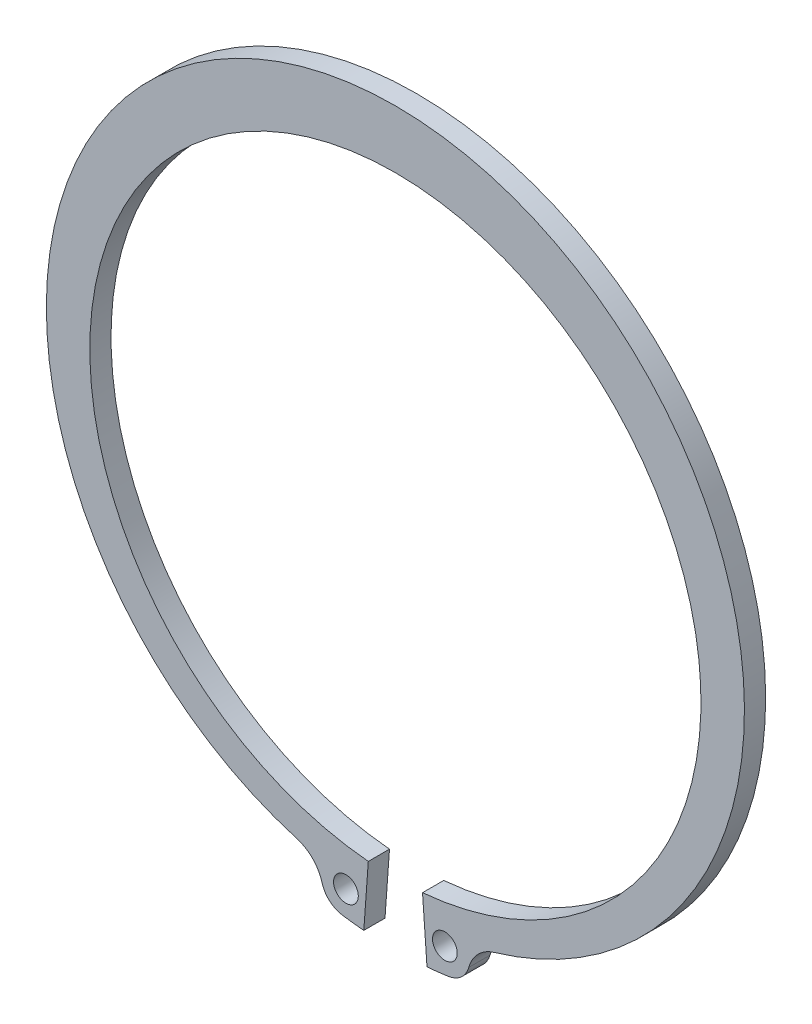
ISO-10303-21;
HEADER;
FILE_DESCRIPTION(('STEP AP214'),'2;1');
FILE_NAME('part.step','',(''),(''),'','','');
FILE_SCHEMA(('AUTOMOTIVE_DESIGN { 1 0 10303 214 1 1 1 1 }'));
ENDSEC;
DATA;
#1=APPLICATION_CONTEXT('core data for automotive mechanical design processes');
#2=APPLICATION_PROTOCOL_DEFINITION('international standard','automotive_design',2000,#1);
#3=PRODUCT_CONTEXT('',#1,'mechanical');
#4=PRODUCT('Part','Part','',(#3));
#5=PRODUCT_RELATED_PRODUCT_CATEGORY('part','',(#4));
#6=PRODUCT_DEFINITION_FORMATION('','',#4);
#7=PRODUCT_DEFINITION_CONTEXT('part definition',#1,'design');
#8=PRODUCT_DEFINITION('design','',#6,#7);
#9=PRODUCT_DEFINITION_SHAPE('','',#8);
#10=(LENGTH_UNIT() NAMED_UNIT(*) SI_UNIT(.MILLI.,.METRE.));
#11=(NAMED_UNIT(*) PLANE_ANGLE_UNIT() SI_UNIT($,.RADIAN.));
#12=(NAMED_UNIT(*) SI_UNIT($,.STERADIAN.) SOLID_ANGLE_UNIT());
#13=UNCERTAINTY_MEASURE_WITH_UNIT(LENGTH_MEASURE(1.E-05),#10,'distance_accuracy_value','');
#14=(GEOMETRIC_REPRESENTATION_CONTEXT(3) GLOBAL_UNCERTAINTY_ASSIGNED_CONTEXT((#13)) GLOBAL_UNIT_ASSIGNED_CONTEXT((#10,
#11,#12)) REPRESENTATION_CONTEXT('',''));
#15=CARTESIAN_POINT('',(0.,0.,0.));
#16=DIRECTION('',(0.,0.,1.));
#17=DIRECTION('',(1.,0.,0.));
#18=AXIS2_PLACEMENT_3D('',#15,#16,#17);
#19=CARTESIAN_POINT('',(0.,0.,3.));
#20=DIRECTION('',(0.,0.,1.));
#21=DIRECTION('',(1.,0.,0.));
#22=AXIS2_PLACEMENT_3D('',#19,#20,#21);
#23=PLANE('',#22);
#24=CARTESIAN_POINT('',(-7.00303678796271,-48.0412585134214,3.));
#25=DIRECTION('',(0.,0.,1.));
#26=DIRECTION('',(-1.,0.,0.));
#27=AXIS2_PLACEMENT_3D('',#24,#25,#26);
#28=CIRCLE('',#27,1.75);
#29=CARTESIAN_POINT('',(-8.75303678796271,-48.0412585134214,3.));
#30=VERTEX_POINT('',#29);
#31=EDGE_CURVE('E127',#30,#30,#28,.T.);
#32=ORIENTED_EDGE('',*,*,#31,.F.);
#33=EDGE_LOOP('',(#32));
#34=FACE_BOUND('',#33,.T.);
#35=CARTESIAN_POINT('',(0.,0.,3.));
#36=DIRECTION('',(0.,0.,-1.));
#37=DIRECTION('',(1.,0.,0.));
#38=AXIS2_PLACEMENT_3D('',#35,#36,#37);
#39=CIRCLE('',#38,43.25);
#40=CARTESIAN_POINT('',(-3.83657516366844,-43.0794985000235,3.));
#41=VERTEX_POINT('',#40);
#42=CARTESIAN_POINT('',(3.83657516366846,-43.0794985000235,3.));
#43=VERTEX_POINT('',#42);
#44=EDGE_CURVE('E149',#41,#43,#39,.T.);
#45=ORIENTED_EDGE('',*,*,#44,.T.);
#46=DIRECTION('',(0.0721920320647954,-0.997390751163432,0.));
#47=VECTOR('',#46,1.);
#48=CARTESIAN_POINT('',(3.83657516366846,-43.0794985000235,3.));
#49=LINE('',#48,#47);
#50=CARTESIAN_POINT('',(4.47186504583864,-51.8565371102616,3.));
#51=VERTEX_POINT('',#50);
#52=EDGE_CURVE('E122',#43,#51,#49,.T.);
#53=ORIENTED_EDGE('',*,*,#52,.T.);
#54=CARTESIAN_POINT('',(0.,0.,3.));
#55=DIRECTION('',(0.,0.,1.));
#56=DIRECTION('',(1.,0.,0.));
#57=AXIS2_PLACEMENT_3D('',#54,#55,#56);
#58=CIRCLE('',#57,52.0489963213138);
#59=CARTESIAN_POINT('',(7.5079005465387,-51.5046546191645,3.));
#60=VERTEX_POINT('',#59);
#61=EDGE_CURVE('E152',#51,#60,#58,.T.);
#62=ORIENTED_EDGE('',*,*,#61,.T.);
#63=CARTESIAN_POINT('',(7.00303678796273,-48.0412585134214,3.));
#64=DIRECTION('',(0.,0.,1.));
#65=DIRECTION('',(1.,0.,0.));
#66=AXIS2_PLACEMENT_3D('',#63,#64,#65);
#67=CIRCLE('',#66,3.49999999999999);
#68=CARTESIAN_POINT('',(10.3762876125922,-48.9746281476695,3.));
#69=VERTEX_POINT('',#68);
#70=EDGE_CURVE('E154',#60,#69,#67,.T.);
#71=ORIENTED_EDGE('',*,*,#70,.T.);
#72=CARTESIAN_POINT('',(15.4361638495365,-50.3746825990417,3.));
#73=DIRECTION('',(0.,0.,-1.));
#74=DIRECTION('',(1.,0.,0.));
#75=AXIS2_PLACEMENT_3D('',#72,#73,#74);
#76=CIRCLE('',#75,5.24999999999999);
#77=CARTESIAN_POINT('',(13.9532752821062,-45.338459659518,3.));
#78=VERTEX_POINT('',#77);
#79=EDGE_CURVE('E156',#69,#78,#76,.T.);
#80=ORIENTED_EDGE('',*,*,#79,.T.);
#81=CARTESIAN_POINT('',(0.,2.05,3.));
#82=DIRECTION('',(0.,0.,1.));
#83=DIRECTION('',(1.,0.,0.));
#84=AXIS2_PLACEMENT_3D('',#81,#82,#83);
#85=CIRCLE('',#84,49.4);
#86=CARTESIAN_POINT('',(-13.9532752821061,-45.338459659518,3.));
#87=VERTEX_POINT('',#86);
#88=EDGE_CURVE('E158',#78,#87,#85,.T.);
#89=ORIENTED_EDGE('',*,*,#88,.T.);
#90=CARTESIAN_POINT('',(-15.4361638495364,-50.3746825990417,3.));
#91=DIRECTION('',(0.,0.,-1.));
#92=DIRECTION('',(-1.,0.,0.));
#93=AXIS2_PLACEMENT_3D('',#90,#91,#92);
#94=CIRCLE('',#93,5.24999999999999);
#95=CARTESIAN_POINT('',(-10.3762876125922,-48.9746281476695,3.));
#96=VERTEX_POINT('',#95);
#97=EDGE_CURVE('E160',#87,#96,#94,.T.);
#98=ORIENTED_EDGE('',*,*,#97,.T.);
#99=CARTESIAN_POINT('',(-7.00303678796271,-48.0412585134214,3.));
#100=DIRECTION('',(0.,0.,1.));
#101=DIRECTION('',(-1.,0.,0.));
#102=AXIS2_PLACEMENT_3D('',#99,#100,#101);
#103=CIRCLE('',#102,3.49999999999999);
#104=CARTESIAN_POINT('',(-7.50790054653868,-51.5046546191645,3.));
#105=VERTEX_POINT('',#104);
#106=EDGE_CURVE('E162',#96,#105,#103,.T.);
#107=ORIENTED_EDGE('',*,*,#106,.T.);
#108=CARTESIAN_POINT('',(0.,0.,3.));
#109=DIRECTION('',(0.,0.,1.));
#110=DIRECTION('',(-1.,0.,0.));
#111=AXIS2_PLACEMENT_3D('',#108,#109,#110);
#112=CIRCLE('',#111,52.0489963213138);
#113=CARTESIAN_POINT('',(-4.47186504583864,-51.8565371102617,3.));
#114=VERTEX_POINT('',#113);
#115=EDGE_CURVE('E51',#105,#114,#112,.T.);
#116=ORIENTED_EDGE('',*,*,#115,.T.);
#117=DIRECTION('',(0.0721920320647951,0.997390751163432,0.));
#118=VECTOR('',#117,1.);
#119=CARTESIAN_POINT('',(-3.83657516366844,-43.0794985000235,3.));
#120=LINE('',#119,#118);
#121=EDGE_CURVE('E46',#114,#41,#120,.T.);
#122=ORIENTED_EDGE('',*,*,#121,.T.);
#123=EDGE_LOOP('',(#45,#53,#62,#71,#80,#89,#98,#107,#116,#122));
#124=FACE_BOUND('',#123,.T.);
#125=CARTESIAN_POINT('',(7.00303678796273,-48.0412585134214,3.));
#126=DIRECTION('',(0.,0.,1.));
#127=DIRECTION('',(1.,0.,0.));
#128=AXIS2_PLACEMENT_3D('',#125,#126,#127);
#129=CIRCLE('',#128,1.75);
#130=CARTESIAN_POINT('',(8.75303678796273,-48.0412585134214,3.));
#131=VERTEX_POINT('',#130);
#132=EDGE_CURVE('E249',#131,#131,#129,.T.);
#133=ORIENTED_EDGE('',*,*,#132,.F.);
#134=EDGE_LOOP('',(#133));
#135=FACE_BOUND('',#134,.T.);
#136=ADVANCED_FACE('F31',(#34,#124,#135),#23,.T.);
#137=CARTESIAN_POINT('',(0.,0.,0.));
#138=DIRECTION('',(0.,0.,1.));
#139=DIRECTION('',(1.,0.,0.));
#140=AXIS2_PLACEMENT_3D('',#137,#138,#139);
#141=PLANE('',#140);
#142=CARTESIAN_POINT('',(-7.00303678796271,-48.0412585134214,0.));
#143=DIRECTION('',(0.,0.,1.));
#144=DIRECTION('',(-1.,0.,0.));
#145=AXIS2_PLACEMENT_3D('',#142,#143,#144);
#146=CIRCLE('',#145,1.75);
#147=CARTESIAN_POINT('',(-8.75303678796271,-48.0412585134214,0.));
#148=VERTEX_POINT('',#147);
#149=EDGE_CURVE('E130',#148,#148,#146,.T.);
#150=ORIENTED_EDGE('',*,*,#149,.T.);
#151=EDGE_LOOP('',(#150));
#152=FACE_BOUND('',#151,.T.);
#153=CARTESIAN_POINT('',(0.,0.,0.));
#154=DIRECTION('',(0.,0.,-1.));
#155=DIRECTION('',(1.,0.,0.));
#156=AXIS2_PLACEMENT_3D('',#153,#154,#155);
#157=CIRCLE('',#156,43.25);
#158=CARTESIAN_POINT('',(-3.83657516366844,-43.0794985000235,0.));
#159=VERTEX_POINT('',#158);
#160=CARTESIAN_POINT('',(3.83657516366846,-43.0794985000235,0.));
#161=VERTEX_POINT('',#160);
#162=EDGE_CURVE('E113',#159,#161,#157,.T.);
#163=ORIENTED_EDGE('',*,*,#162,.F.);
#164=DIRECTION('',(0.0721920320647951,0.997390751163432,0.));
#165=VECTOR('',#164,1.);
#166=CARTESIAN_POINT('',(-3.83657516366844,-43.0794985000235,0.));
#167=LINE('',#166,#165);
#168=CARTESIAN_POINT('',(-4.47186504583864,-51.8565371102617,0.));
#169=VERTEX_POINT('',#168);
#170=EDGE_CURVE('E147',#169,#159,#167,.T.);
#171=ORIENTED_EDGE('',*,*,#170,.F.);
#172=CARTESIAN_POINT('',(0.,0.,0.));
#173=DIRECTION('',(0.,0.,1.));
#174=DIRECTION('',(-1.,0.,0.));
#175=AXIS2_PLACEMENT_3D('',#172,#173,#174);
#176=CIRCLE('',#175,52.0489963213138);
#177=CARTESIAN_POINT('',(-7.50790054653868,-51.5046546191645,0.));
#178=VERTEX_POINT('',#177);
#179=EDGE_CURVE('E145',#178,#169,#176,.T.);
#180=ORIENTED_EDGE('',*,*,#179,.F.);
#181=CARTESIAN_POINT('',(-7.00303678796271,-48.0412585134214,0.));
#182=DIRECTION('',(0.,0.,1.));
#183=DIRECTION('',(-1.,0.,0.));
#184=AXIS2_PLACEMENT_3D('',#181,#182,#183);
#185=CIRCLE('',#184,3.49999999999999);
#186=CARTESIAN_POINT('',(-10.3762876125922,-48.9746281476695,0.));
#187=VERTEX_POINT('',#186);
#188=EDGE_CURVE('E143',#187,#178,#185,.T.);
#189=ORIENTED_EDGE('',*,*,#188,.F.);
#190=CARTESIAN_POINT('',(-15.4361638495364,-50.3746825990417,0.));
#191=DIRECTION('',(0.,0.,-1.));
#192=DIRECTION('',(-1.,0.,0.));
#193=AXIS2_PLACEMENT_3D('',#190,#191,#192);
#194=CIRCLE('',#193,5.24999999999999);
#195=CARTESIAN_POINT('',(-13.9532752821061,-45.338459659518,0.));
#196=VERTEX_POINT('',#195);
#197=EDGE_CURVE('E141',#196,#187,#194,.T.);
#198=ORIENTED_EDGE('',*,*,#197,.F.);
#199=CARTESIAN_POINT('',(0.,2.05,0.));
#200=DIRECTION('',(0.,0.,1.));
#201=DIRECTION('',(1.,0.,0.));
#202=AXIS2_PLACEMENT_3D('',#199,#200,#201);
#203=CIRCLE('',#202,49.4);
#204=CARTESIAN_POINT('',(13.9532752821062,-45.338459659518,0.));
#205=VERTEX_POINT('',#204);
#206=EDGE_CURVE('E139',#205,#196,#203,.T.);
#207=ORIENTED_EDGE('',*,*,#206,.F.);
#208=CARTESIAN_POINT('',(15.4361638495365,-50.3746825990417,0.));
#209=DIRECTION('',(0.,0.,-1.));
#210=DIRECTION('',(1.,0.,0.));
#211=AXIS2_PLACEMENT_3D('',#208,#209,#210);
#212=CIRCLE('',#211,5.24999999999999);
#213=CARTESIAN_POINT('',(10.3762876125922,-48.9746281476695,0.));
#214=VERTEX_POINT('',#213);
#215=EDGE_CURVE('E137',#214,#205,#212,.T.);
#216=ORIENTED_EDGE('',*,*,#215,.F.);
#217=CARTESIAN_POINT('',(7.00303678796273,-48.0412585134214,0.));
#218=DIRECTION('',(0.,0.,1.));
#219=DIRECTION('',(1.,0.,0.));
#220=AXIS2_PLACEMENT_3D('',#217,#218,#219);
#221=CIRCLE('',#220,3.49999999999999);
#222=CARTESIAN_POINT('',(7.5079005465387,-51.5046546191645,0.));
#223=VERTEX_POINT('',#222);
#224=EDGE_CURVE('E135',#223,#214,#221,.T.);
#225=ORIENTED_EDGE('',*,*,#224,.F.);
#226=CARTESIAN_POINT('',(0.,0.,0.));
#227=DIRECTION('',(0.,0.,1.));
#228=DIRECTION('',(1.,0.,0.));
#229=AXIS2_PLACEMENT_3D('',#226,#227,#228);
#230=CIRCLE('',#229,52.0489963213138);
#231=CARTESIAN_POINT('',(4.47186504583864,-51.8565371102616,0.));
#232=VERTEX_POINT('',#231);
#233=EDGE_CURVE('E115',#232,#223,#230,.T.);
#234=ORIENTED_EDGE('',*,*,#233,.F.);
#235=DIRECTION('',(0.0721920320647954,-0.997390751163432,0.));
#236=VECTOR('',#235,1.);
#237=CARTESIAN_POINT('',(3.83657516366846,-43.0794985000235,0.));
#238=LINE('',#237,#236);
#239=EDGE_CURVE('E108',#161,#232,#238,.T.);
#240=ORIENTED_EDGE('',*,*,#239,.F.);
#241=EDGE_LOOP('',(#163,#171,#180,#189,#198,#207,#216,#225,#234,#240));
#242=FACE_BOUND('',#241,.T.);
#243=CARTESIAN_POINT('',(7.00303678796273,-48.0412585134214,0.));
#244=DIRECTION('',(0.,0.,1.));
#245=DIRECTION('',(1.,0.,0.));
#246=AXIS2_PLACEMENT_3D('',#243,#244,#245);
#247=CIRCLE('',#246,1.75);
#248=CARTESIAN_POINT('',(8.75303678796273,-48.0412585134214,0.));
#249=VERTEX_POINT('',#248);
#250=EDGE_CURVE('E252',#249,#249,#247,.T.);
#251=ORIENTED_EDGE('',*,*,#250,.T.);
#252=EDGE_LOOP('',(#251));
#253=FACE_BOUND('',#252,.T.);
#254=ADVANCED_FACE('F109',(#152,#242,#253),#141,.F.);
#255=CARTESIAN_POINT('',(0.,0.,3.));
#256=DIRECTION('',(0.,0.,-1.));
#257=DIRECTION('',(-1.,0.,0.));
#258=AXIS2_PLACEMENT_3D('',#255,#256,#257);
#259=CYLINDRICAL_SURFACE('',#258,43.25);
#260=ORIENTED_EDGE('',*,*,#162,.T.);
#261=DIRECTION('',(0.,0.,-1.));
#262=VECTOR('',#261,1.);
#263=CARTESIAN_POINT('',(3.83657516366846,-43.0794985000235,3.));
#264=LINE('',#263,#262);
#265=EDGE_CURVE('E11',#43,#161,#264,.T.);
#266=ORIENTED_EDGE('',*,*,#265,.F.);
#267=ORIENTED_EDGE('',*,*,#44,.F.);
#268=DIRECTION('',(0.,0.,-1.));
#269=VECTOR('',#268,1.);
#270=CARTESIAN_POINT('',(-3.83657516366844,-43.0794985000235,3.));
#271=LINE('',#270,#269);
#272=EDGE_CURVE('E126',#41,#159,#271,.T.);
#273=ORIENTED_EDGE('',*,*,#272,.T.);
#274=EDGE_LOOP('',(#260,#266,#267,#273));
#275=FACE_BOUND('',#274,.T.);
#276=ADVANCED_FACE('F33',(#275),#259,.F.);
#277=CARTESIAN_POINT('',(3.83657516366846,-43.0794985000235,3.));
#278=DIRECTION('',(0.997390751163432,0.0721920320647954,0.));
#279=DIRECTION('',(-0.0721920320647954,0.997390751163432,0.));
#280=AXIS2_PLACEMENT_3D('',#277,#278,#279);
#281=PLANE('',#280);
#282=ORIENTED_EDGE('',*,*,#239,.T.);
#283=DIRECTION('',(0.,0.,-1.));
#284=VECTOR('',#283,1.);
#285=CARTESIAN_POINT('',(4.47186504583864,-51.8565371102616,3.));
#286=LINE('',#285,#284);
#287=EDGE_CURVE('E39',#51,#232,#286,.T.);
#288=ORIENTED_EDGE('',*,*,#287,.F.);
#289=ORIENTED_EDGE('',*,*,#52,.F.);
#290=ORIENTED_EDGE('',*,*,#265,.T.);
#291=EDGE_LOOP('',(#282,#288,#289,#290));
#292=FACE_BOUND('',#291,.T.);
#293=ADVANCED_FACE('F121',(#292),#281,.F.);
#294=CARTESIAN_POINT('',(0.,0.,3.));
#295=DIRECTION('',(0.,0.,-1.));
#296=DIRECTION('',(-1.,0.,0.));
#297=AXIS2_PLACEMENT_3D('',#294,#295,#296);
#298=CYLINDRICAL_SURFACE('',#297,52.0489963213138);
#299=ORIENTED_EDGE('',*,*,#233,.T.);
#300=DIRECTION('',(0.,0.,-1.));
#301=VECTOR('',#300,1.);
#302=CARTESIAN_POINT('',(7.5079005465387,-51.5046546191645,3.));
#303=LINE('',#302,#301);
#304=EDGE_CURVE('E185',#60,#223,#303,.T.);
#305=ORIENTED_EDGE('',*,*,#304,.F.);
#306=ORIENTED_EDGE('',*,*,#61,.F.);
#307=ORIENTED_EDGE('',*,*,#287,.T.);
#308=EDGE_LOOP('',(#299,#305,#306,#307));
#309=FACE_BOUND('',#308,.T.);
#310=ADVANCED_FACE('F189',(#309),#298,.T.);
#311=CARTESIAN_POINT('',(7.00303678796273,-48.0412585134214,3.));
#312=DIRECTION('',(0.,0.,-1.));
#313=DIRECTION('',(-1.,0.,0.));
#314=AXIS2_PLACEMENT_3D('',#311,#312,#313);
#315=CYLINDRICAL_SURFACE('',#314,3.49999999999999);
#316=ORIENTED_EDGE('',*,*,#224,.T.);
#317=DIRECTION('',(0.,0.,-1.));
#318=VECTOR('',#317,1.);
#319=CARTESIAN_POINT('',(10.3762876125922,-48.9746281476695,3.));
#320=LINE('',#319,#318);
#321=EDGE_CURVE('E182',#69,#214,#320,.T.);
#322=ORIENTED_EDGE('',*,*,#321,.F.);
#323=ORIENTED_EDGE('',*,*,#70,.F.);
#324=ORIENTED_EDGE('',*,*,#304,.T.);
#325=EDGE_LOOP('',(#316,#322,#323,#324));
#326=FACE_BOUND('',#325,.T.);
#327=ADVANCED_FACE('F197',(#326),#315,.T.);
#328=CARTESIAN_POINT('',(15.4361638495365,-50.3746825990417,3.));
#329=DIRECTION('',(0.,0.,-1.));
#330=DIRECTION('',(-1.,0.,0.));
#331=AXIS2_PLACEMENT_3D('',#328,#329,#330);
#332=CYLINDRICAL_SURFACE('',#331,5.24999999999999);
#333=ORIENTED_EDGE('',*,*,#215,.T.);
#334=DIRECTION('',(0.,0.,-1.));
#335=VECTOR('',#334,1.);
#336=CARTESIAN_POINT('',(13.9532752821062,-45.338459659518,3.));
#337=LINE('',#336,#335);
#338=EDGE_CURVE('E179',#78,#205,#337,.T.);
#339=ORIENTED_EDGE('',*,*,#338,.F.);
#340=ORIENTED_EDGE('',*,*,#79,.F.);
#341=ORIENTED_EDGE('',*,*,#321,.T.);
#342=EDGE_LOOP('',(#333,#339,#340,#341));
#343=FACE_BOUND('',#342,.T.);
#344=ADVANCED_FACE('F200',(#343),#332,.F.);
#345=CARTESIAN_POINT('',(0.,2.05,3.));
#346=DIRECTION('',(0.,0.,-1.));
#347=DIRECTION('',(-1.,0.,0.));
#348=AXIS2_PLACEMENT_3D('',#345,#346,#347);
#349=CYLINDRICAL_SURFACE('',#348,49.4);
#350=ORIENTED_EDGE('',*,*,#206,.T.);
#351=DIRECTION('',(0.,0.,-1.));
#352=VECTOR('',#351,1.);
#353=CARTESIAN_POINT('',(-13.9532752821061,-45.338459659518,3.));
#354=LINE('',#353,#352);
#355=EDGE_CURVE('E176',#87,#196,#354,.T.);
#356=ORIENTED_EDGE('',*,*,#355,.F.);
#357=ORIENTED_EDGE('',*,*,#88,.F.);
#358=ORIENTED_EDGE('',*,*,#338,.T.);
#359=EDGE_LOOP('',(#350,#356,#357,#358));
#360=FACE_BOUND('',#359,.T.);
#361=ADVANCED_FACE('F205',(#360),#349,.T.);
#362=CARTESIAN_POINT('',(-15.4361638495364,-50.3746825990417,3.));
#363=DIRECTION('',(0.,0.,-1.));
#364=DIRECTION('',(-1.,0.,0.));
#365=AXIS2_PLACEMENT_3D('',#362,#363,#364);
#366=CYLINDRICAL_SURFACE('',#365,5.24999999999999);
#367=ORIENTED_EDGE('',*,*,#197,.T.);
#368=DIRECTION('',(0.,0.,-1.));
#369=VECTOR('',#368,1.);
#370=CARTESIAN_POINT('',(-10.3762876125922,-48.9746281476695,3.));
#371=LINE('',#370,#369);
#372=EDGE_CURVE('E173',#96,#187,#371,.T.);
#373=ORIENTED_EDGE('',*,*,#372,.F.);
#374=ORIENTED_EDGE('',*,*,#97,.F.);
#375=ORIENTED_EDGE('',*,*,#355,.T.);
#376=EDGE_LOOP('',(#367,#373,#374,#375));
#377=FACE_BOUND('',#376,.T.);
#378=ADVANCED_FACE('F211',(#377),#366,.F.);
#379=CARTESIAN_POINT('',(-7.00303678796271,-48.0412585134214,3.));
#380=DIRECTION('',(0.,0.,-1.));
#381=DIRECTION('',(-1.,0.,0.));
#382=AXIS2_PLACEMENT_3D('',#379,#380,#381);
#383=CYLINDRICAL_SURFACE('',#382,3.49999999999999);
#384=ORIENTED_EDGE('',*,*,#188,.T.);
#385=DIRECTION('',(0.,0.,-1.));
#386=VECTOR('',#385,1.);
#387=CARTESIAN_POINT('',(-7.50790054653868,-51.5046546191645,3.));
#388=LINE('',#387,#386);
#389=EDGE_CURVE('E170',#105,#178,#388,.T.);
#390=ORIENTED_EDGE('',*,*,#389,.F.);
#391=ORIENTED_EDGE('',*,*,#106,.F.);
#392=ORIENTED_EDGE('',*,*,#372,.T.);
#393=EDGE_LOOP('',(#384,#390,#391,#392));
#394=FACE_BOUND('',#393,.T.);
#395=ADVANCED_FACE('F215',(#394),#383,.T.);
#396=CARTESIAN_POINT('',(0.,0.,3.));
#397=DIRECTION('',(0.,0.,-1.));
#398=DIRECTION('',(-1.,0.,0.));
#399=AXIS2_PLACEMENT_3D('',#396,#397,#398);
#400=CYLINDRICAL_SURFACE('',#399,52.0489963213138);
#401=ORIENTED_EDGE('',*,*,#179,.T.);
#402=DIRECTION('',(0.,0.,-1.));
#403=VECTOR('',#402,1.);
#404=CARTESIAN_POINT('',(-4.47186504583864,-51.8565371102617,3.));
#405=LINE('',#404,#403);
#406=EDGE_CURVE('E167',#114,#169,#405,.T.);
#407=ORIENTED_EDGE('',*,*,#406,.F.);
#408=ORIENTED_EDGE('',*,*,#115,.F.);
#409=ORIENTED_EDGE('',*,*,#389,.T.);
#410=EDGE_LOOP('',(#401,#407,#408,#409));
#411=FACE_BOUND('',#410,.T.);
#412=ADVANCED_FACE('F218',(#411),#400,.T.);
#413=CARTESIAN_POINT('',(-3.83657516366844,-43.0794985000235,3.));
#414=DIRECTION('',(-0.997390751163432,0.0721920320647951,0.));
#415=DIRECTION('',(-0.0721920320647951,-0.997390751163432,0.));
#416=AXIS2_PLACEMENT_3D('',#413,#414,#415);
#417=PLANE('',#416);
#418=ORIENTED_EDGE('',*,*,#170,.T.);
#419=ORIENTED_EDGE('',*,*,#272,.F.);
#420=ORIENTED_EDGE('',*,*,#121,.F.);
#421=ORIENTED_EDGE('',*,*,#406,.T.);
#422=EDGE_LOOP('',(#418,#419,#420,#421));
#423=FACE_BOUND('',#422,.T.);
#424=ADVANCED_FACE('F220',(#423),#417,.F.);
#425=CARTESIAN_POINT('',(-7.00303678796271,-48.0412585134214,3.));
#426=DIRECTION('',(0.,0.,-1.));
#427=DIRECTION('',(-1.,0.,0.));
#428=AXIS2_PLACEMENT_3D('',#425,#426,#427);
#429=CYLINDRICAL_SURFACE('',#428,1.75);
#430=ORIENTED_EDGE('',*,*,#31,.T.);
#431=EDGE_LOOP('',(#430));
#432=FACE_BOUND('',#431,.T.);
#433=ORIENTED_EDGE('',*,*,#149,.F.);
#434=EDGE_LOOP('',(#433));
#435=FACE_BOUND('',#434,.T.);
#436=ADVANCED_FACE('F222',(#432,#435),#429,.F.);
#437=CARTESIAN_POINT('',(7.00303678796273,-48.0412585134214,3.));
#438=DIRECTION('',(0.,0.,-1.));
#439=DIRECTION('',(-1.,0.,0.));
#440=AXIS2_PLACEMENT_3D('',#437,#438,#439);
#441=CYLINDRICAL_SURFACE('',#440,1.75);
#442=ORIENTED_EDGE('',*,*,#132,.T.);
#443=EDGE_LOOP('',(#442));
#444=FACE_BOUND('',#443,.T.);
#445=ORIENTED_EDGE('',*,*,#250,.F.);
#446=EDGE_LOOP('',(#445));
#447=FACE_BOUND('',#446,.T.);
#448=ADVANCED_FACE('F228',(#444,#447),#441,.F.);
#449=CLOSED_SHELL('',(#136,#254,#276,#293,#310,#327,#344,#361,#378,#395,#412,#424,#436,#448));
#450=MANIFOLD_SOLID_BREP('B2',#449);
#451=ADVANCED_BREP_SHAPE_REPRESENTATION('',(#18,#450),#14);
#452=SHAPE_DEFINITION_REPRESENTATION(#9,#451);
ENDSEC;
END-ISO-10303-21;
